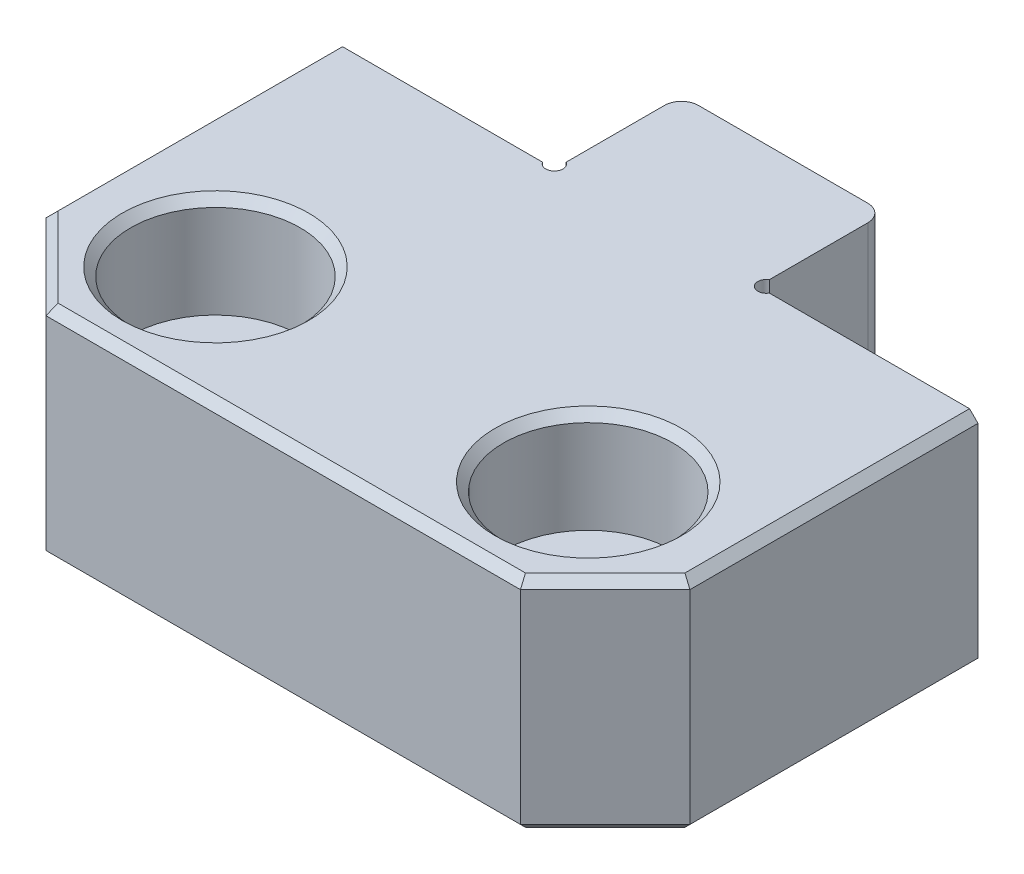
ISO-10303-21;
HEADER;
FILE_DESCRIPTION(('STEP AP214'),'2;1');
FILE_NAME('part.step','',(''),(''),'','','');
FILE_SCHEMA(('AUTOMOTIVE_DESIGN { 1 0 10303 214 1 1 1 1 }'));
ENDSEC;
DATA;
#1=APPLICATION_CONTEXT('core data for automotive mechanical design processes');
#2=APPLICATION_PROTOCOL_DEFINITION('international standard','automotive_design',2000,#1);
#3=PRODUCT_CONTEXT('',#1,'mechanical');
#4=PRODUCT('Part','Part','',(#3));
#5=PRODUCT_RELATED_PRODUCT_CATEGORY('part','',(#4));
#6=PRODUCT_DEFINITION_FORMATION('','',#4);
#7=PRODUCT_DEFINITION_CONTEXT('part definition',#1,'design');
#8=PRODUCT_DEFINITION('design','',#6,#7);
#9=PRODUCT_DEFINITION_SHAPE('','',#8);
#10=(LENGTH_UNIT() NAMED_UNIT(*) SI_UNIT(.MILLI.,.METRE.));
#11=(NAMED_UNIT(*) PLANE_ANGLE_UNIT() SI_UNIT($,.RADIAN.));
#12=(NAMED_UNIT(*) SI_UNIT($,.STERADIAN.) SOLID_ANGLE_UNIT());
#13=UNCERTAINTY_MEASURE_WITH_UNIT(LENGTH_MEASURE(1.E-05),#10,'distance_accuracy_value','');
#14=(GEOMETRIC_REPRESENTATION_CONTEXT(3) GLOBAL_UNCERTAINTY_ASSIGNED_CONTEXT((#13)) GLOBAL_UNIT_ASSIGNED_CONTEXT((#10,
#11,#12)) REPRESENTATION_CONTEXT('',''));
#15=CARTESIAN_POINT('',(0.,0.,0.));
#16=DIRECTION('',(0.,0.,1.));
#17=DIRECTION('',(1.,0.,0.));
#18=AXIS2_PLACEMENT_3D('',#15,#16,#17);
#19=CARTESIAN_POINT('',(-6.254,0.,-0.254));
#20=DIRECTION('',(0.,1.,0.));
#21=DIRECTION('',(0.,0.,1.));
#22=AXIS2_PLACEMENT_3D('',#19,#20,#21);
#23=PLANE('',#22);
#24=CARTESIAN_POINT('',(-11.,0.,15.));
#25=DIRECTION('',(0.,1.,0.));
#26=DIRECTION('',(0.,0.,1.));
#27=AXIS2_PLACEMENT_3D('',#24,#25,#26);
#28=CIRCLE('',#27,5.5);
#29=CARTESIAN_POINT('',(-11.,0.,20.5));
#30=VERTEX_POINT('',#29);
#31=EDGE_CURVE('E363',#30,#30,#28,.F.);
#32=ORIENTED_EDGE('',*,*,#31,.T.);
#33=EDGE_LOOP('',(#32));
#34=FACE_BOUND('',#33,.T.);
#35=CARTESIAN_POINT('',(11.,0.,15.));
#36=DIRECTION('',(0.,1.,0.));
#37=DIRECTION('',(0.,0.,1.));
#38=AXIS2_PLACEMENT_3D('',#35,#36,#37);
#39=CIRCLE('',#38,5.50000000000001);
#40=CARTESIAN_POINT('',(11.,0.,20.5));
#41=VERTEX_POINT('',#40);
#42=EDGE_CURVE('E360',#41,#41,#39,.F.);
#43=ORIENTED_EDGE('',*,*,#42,.T.);
#44=EDGE_LOOP('',(#43));
#45=FACE_BOUND('',#44,.T.);
#46=DIRECTION('',(0.707106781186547,0.,-0.707106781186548));
#47=VECTOR('',#46,1.);
#48=CARTESIAN_POINT('',(14.6464466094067,0.,20.6464466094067));
#49=LINE('',#48,#47);
#50=CARTESIAN_POINT('',(13.7928932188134,0.,21.5));
#51=VERTEX_POINT('',#50);
#52=CARTESIAN_POINT('',(18.5,0.,16.7928932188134));
#53=VERTEX_POINT('',#52);
#54=EDGE_CURVE('E54',#51,#53,#49,.T.);
#55=ORIENTED_EDGE('',*,*,#54,.T.);
#56=DIRECTION('',(0.,0.,-1.));
#57=VECTOR('',#56,1.);
#58=CARTESIAN_POINT('',(18.5,0.,-0.253999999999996));
#59=LINE('',#58,#57);
#60=CARTESIAN_POINT('',(18.5,0.,0.));
#61=VERTEX_POINT('',#60);
#62=EDGE_CURVE('E332',#53,#61,#59,.T.);
#63=ORIENTED_EDGE('',*,*,#62,.T.);
#64=DIRECTION('',(-1.,0.,0.));
#65=VECTOR('',#64,1.);
#66=CARTESIAN_POINT('',(6.68467853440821,0.,0.));
#67=LINE('',#66,#65);
#68=CARTESIAN_POINT('',(6.68467853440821,0.,0.));
#69=VERTEX_POINT('',#68);
#70=EDGE_CURVE('E217',#61,#69,#67,.T.);
#71=ORIENTED_EDGE('',*,*,#70,.T.);
#72=CARTESIAN_POINT('',(6.254,0.,-0.254));
#73=DIRECTION('',(0.,-1.,0.));
#74=DIRECTION('',(0.,0.,1.));
#75=AXIS2_PLACEMENT_3D('',#72,#73,#74);
#76=CIRCLE('',#75,0.5);
#77=CARTESIAN_POINT('',(6.,0.,-0.684678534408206));
#78=VERTEX_POINT('',#77);
#79=EDGE_CURVE('E220',#69,#78,#76,.T.);
#80=ORIENTED_EDGE('',*,*,#79,.T.);
#81=DIRECTION('',(0.,0.,-1.));
#82=VECTOR('',#81,1.);
#83=CARTESIAN_POINT('',(6.,0.,-7.5));
#84=LINE('',#83,#82);
#85=CARTESIAN_POINT('',(6.,0.,-6.5));
#86=VERTEX_POINT('',#85);
#87=EDGE_CURVE('E224',#78,#86,#84,.T.);
#88=ORIENTED_EDGE('',*,*,#87,.T.);
#89=CARTESIAN_POINT('',(5.,0.,-6.5));
#90=DIRECTION('',(0.,1.,0.));
#91=DIRECTION('',(0.,0.,1.));
#92=AXIS2_PLACEMENT_3D('',#89,#90,#91);
#93=CIRCLE('',#92,1.);
#94=CARTESIAN_POINT('',(5.,0.,-7.5));
#95=VERTEX_POINT('',#94);
#96=EDGE_CURVE('E255',#86,#95,#93,.T.);
#97=ORIENTED_EDGE('',*,*,#96,.T.);
#98=DIRECTION('',(-1.,0.,0.));
#99=VECTOR('',#98,1.);
#100=CARTESIAN_POINT('',(-6.,0.,-7.5));
#101=LINE('',#100,#99);
#102=CARTESIAN_POINT('',(-5.,0.,-7.5));
#103=VERTEX_POINT('',#102);
#104=EDGE_CURVE('E227',#95,#103,#101,.T.);
#105=ORIENTED_EDGE('',*,*,#104,.T.);
#106=CARTESIAN_POINT('',(-5.,0.,-6.5));
#107=DIRECTION('',(0.,1.,0.));
#108=DIRECTION('',(0.,0.,1.));
#109=AXIS2_PLACEMENT_3D('',#106,#107,#108);
#110=CIRCLE('',#109,1.);
#111=CARTESIAN_POINT('',(-6.,0.,-6.5));
#112=VERTEX_POINT('',#111);
#113=EDGE_CURVE('E257',#103,#112,#110,.T.);
#114=ORIENTED_EDGE('',*,*,#113,.T.);
#115=DIRECTION('',(0.,0.,1.));
#116=VECTOR('',#115,1.);
#117=CARTESIAN_POINT('',(-6.,0.,-0.693940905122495));
#118=LINE('',#117,#116);
#119=CARTESIAN_POINT('',(-6.,0.,-0.693940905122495));
#120=VERTEX_POINT('',#119);
#121=EDGE_CURVE('E230',#112,#120,#118,.T.);
#122=ORIENTED_EDGE('',*,*,#121,.T.);
#123=CARTESIAN_POINT('',(-6.254,0.,-0.254));
#124=DIRECTION('',(0.,-1.,0.));
#125=DIRECTION('',(0.,0.,1.));
#126=AXIS2_PLACEMENT_3D('',#123,#124,#125);
#127=CIRCLE('',#126,0.508);
#128=CARTESIAN_POINT('',(-6.69394090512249,0.,0.));
#129=VERTEX_POINT('',#128);
#130=EDGE_CURVE('E233',#120,#129,#127,.T.);
#131=ORIENTED_EDGE('',*,*,#130,.T.);
#132=DIRECTION('',(-1.,0.,0.));
#133=VECTOR('',#132,1.);
#134=CARTESIAN_POINT('',(-19.,0.,0.));
#135=LINE('',#134,#133);
#136=CARTESIAN_POINT('',(-18.5,0.,0.));
#137=VERTEX_POINT('',#136);
#138=EDGE_CURVE('E211',#129,#137,#135,.T.);
#139=ORIENTED_EDGE('',*,*,#138,.T.);
#140=DIRECTION('',(0.,0.,1.));
#141=VECTOR('',#140,1.);
#142=CARTESIAN_POINT('',(-18.5,0.,-0.254000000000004));
#143=LINE('',#142,#141);
#144=CARTESIAN_POINT('',(-18.5,0.,16.7928932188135));
#145=VERTEX_POINT('',#144);
#146=EDGE_CURVE('E325',#137,#145,#143,.T.);
#147=ORIENTED_EDGE('',*,*,#146,.T.);
#148=DIRECTION('',(0.707106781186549,0.,0.707106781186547));
#149=VECTOR('',#148,1.);
#150=CARTESIAN_POINT('',(-20.9004466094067,0.,14.3924466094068));
#151=LINE('',#150,#149);
#152=CARTESIAN_POINT('',(-13.7928932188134,0.,21.5));
#153=VERTEX_POINT('',#152);
#154=EDGE_CURVE('E327',#145,#153,#151,.T.);
#155=ORIENTED_EDGE('',*,*,#154,.T.);
#156=DIRECTION('',(1.,0.,0.));
#157=VECTOR('',#156,1.);
#158=CARTESIAN_POINT('',(-6.254,0.,21.5));
#159=LINE('',#158,#157);
#160=EDGE_CURVE('E329',#153,#51,#159,.T.);
#161=ORIENTED_EDGE('',*,*,#160,.T.);
#162=EDGE_LOOP('',(#55,#63,#71,#80,#88,#97,#105,#114,#122,#131,#139,#147,#155,#161));
#163=FACE_BOUND('',#162,.T.);
#164=ADVANCED_FACE('F32',(#34,#45,#163),#23,.T.);
#165=CARTESIAN_POINT('',(11.,-13.,15.));
#166=DIRECTION('',(0.,1.,0.));
#167=DIRECTION('',(0.,0.,1.));
#168=AXIS2_PLACEMENT_3D('',#165,#166,#167);
#169=CYLINDRICAL_SURFACE('',#168,2.9);
#170=CARTESIAN_POINT('',(11.,-13.,15.));
#171=DIRECTION('',(0.,1.,0.));
#172=DIRECTION('',(0.,0.,1.));
#173=AXIS2_PLACEMENT_3D('',#170,#171,#172);
#174=CIRCLE('',#173,2.9);
#175=CARTESIAN_POINT('',(11.,-13.,17.9));
#176=VERTEX_POINT('',#175);
#177=EDGE_CURVE('E280',#176,#176,#174,.T.);
#178=CARTESIAN_POINT('',(11.,-6.,15.));
#179=DIRECTION('',(0.,1.,0.));
#180=DIRECTION('',(0.,0.,1.));
#181=AXIS2_PLACEMENT_3D('',#178,#179,#180);
#182=CIRCLE('',#181,2.9);
#183=CARTESIAN_POINT('',(11.,-6.,17.9));
#184=VERTEX_POINT('',#183);
#185=EDGE_CURVE('E282',#184,#184,#182,.F.);
#186=CARTESIAN_POINT('',(11.,-13.,17.9));
#187=CARTESIAN_POINT('',(11.,-12.9270833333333,17.9));
#188=CARTESIAN_POINT('',(11.,-12.8541666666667,17.9));
#189=CARTESIAN_POINT('',(11.,-12.7083333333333,17.9));
#190=CARTESIAN_POINT('',(11.,-12.6354166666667,17.9));
#191=CARTESIAN_POINT('',(11.,-12.4895833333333,17.9));
#192=CARTESIAN_POINT('',(11.,-12.4166666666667,17.9));
#193=CARTESIAN_POINT('',(11.,-12.2708333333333,17.9));
#194=CARTESIAN_POINT('',(11.,-12.1979166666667,17.9));
#195=CARTESIAN_POINT('',(11.,-12.0520833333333,17.9));
#196=CARTESIAN_POINT('',(11.,-11.9791666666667,17.9));
#197=CARTESIAN_POINT('',(11.,-11.8333333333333,17.9));
#198=CARTESIAN_POINT('',(11.,-11.7604166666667,17.9));
#199=CARTESIAN_POINT('',(11.,-11.6145833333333,17.9));
#200=CARTESIAN_POINT('',(11.,-11.5416666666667,17.9));
#201=CARTESIAN_POINT('',(11.,-11.3958333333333,17.9));
#202=CARTESIAN_POINT('',(11.,-11.3229166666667,17.9));
#203=CARTESIAN_POINT('',(11.,-11.1770833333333,17.9));
#204=CARTESIAN_POINT('',(11.,-11.1041666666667,17.9));
#205=CARTESIAN_POINT('',(11.,-10.9583333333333,17.9));
#206=CARTESIAN_POINT('',(11.,-10.8854166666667,17.9));
#207=CARTESIAN_POINT('',(11.,-10.7395833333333,17.9));
#208=CARTESIAN_POINT('',(11.,-10.6666666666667,17.9));
#209=CARTESIAN_POINT('',(11.,-10.5208333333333,17.9));
#210=CARTESIAN_POINT('',(11.,-10.4479166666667,17.9));
#211=CARTESIAN_POINT('',(11.,-10.3020833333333,17.9));
#212=CARTESIAN_POINT('',(11.,-10.2291666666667,17.9));
#213=CARTESIAN_POINT('',(11.,-10.0833333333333,17.9));
#214=CARTESIAN_POINT('',(11.,-10.0104166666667,17.9));
#215=CARTESIAN_POINT('',(11.,-9.86458333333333,17.9));
#216=CARTESIAN_POINT('',(11.,-9.79166666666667,17.9));
#217=CARTESIAN_POINT('',(11.,-9.64583333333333,17.9));
#218=CARTESIAN_POINT('',(11.,-9.57291666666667,17.9));
#219=CARTESIAN_POINT('',(11.,-9.42708333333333,17.9));
#220=CARTESIAN_POINT('',(11.,-9.35416666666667,17.9));
#221=CARTESIAN_POINT('',(11.,-9.20833333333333,17.9));
#222=CARTESIAN_POINT('',(11.,-9.13541666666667,17.9));
#223=CARTESIAN_POINT('',(11.,-8.98958333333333,17.9));
#224=CARTESIAN_POINT('',(11.,-8.91666666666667,17.9));
#225=CARTESIAN_POINT('',(11.,-8.77083333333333,17.9));
#226=CARTESIAN_POINT('',(11.,-8.69791666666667,17.9));
#227=CARTESIAN_POINT('',(11.,-8.55208333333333,17.9));
#228=CARTESIAN_POINT('',(11.,-8.47916666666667,17.9));
#229=CARTESIAN_POINT('',(11.,-8.33333333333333,17.9));
#230=CARTESIAN_POINT('',(11.,-8.26041666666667,17.9));
#231=CARTESIAN_POINT('',(11.,-8.11458333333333,17.9));
#232=CARTESIAN_POINT('',(11.,-8.04166666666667,17.9));
#233=CARTESIAN_POINT('',(11.,-7.89583333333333,17.9));
#234=CARTESIAN_POINT('',(11.,-7.82291666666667,17.9));
#235=CARTESIAN_POINT('',(11.,-7.67708333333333,17.9));
#236=CARTESIAN_POINT('',(11.,-7.60416666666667,17.9));
#237=CARTESIAN_POINT('',(11.,-7.45833333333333,17.9));
#238=CARTESIAN_POINT('',(11.,-7.38541666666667,17.9));
#239=CARTESIAN_POINT('',(11.,-7.23958333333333,17.9));
#240=CARTESIAN_POINT('',(11.,-7.16666666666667,17.9));
#241=CARTESIAN_POINT('',(11.,-7.02083333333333,17.9));
#242=CARTESIAN_POINT('',(11.,-6.94791666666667,17.9));
#243=CARTESIAN_POINT('',(11.,-6.80208333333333,17.9));
#244=CARTESIAN_POINT('',(11.,-6.72916666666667,17.9));
#245=CARTESIAN_POINT('',(11.,-6.58333333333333,17.9));
#246=CARTESIAN_POINT('',(11.,-6.51041666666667,17.9));
#247=CARTESIAN_POINT('',(11.,-6.36458333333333,17.9));
#248=CARTESIAN_POINT('',(11.,-6.29166666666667,17.9));
#249=CARTESIAN_POINT('',(11.,-6.14583333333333,17.9));
#250=CARTESIAN_POINT('',(11.,-6.07291666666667,17.9));
#251=CARTESIAN_POINT('',(11.,-6.,17.9));
#252=B_SPLINE_CURVE_WITH_KNOTS('',3,(#186,#187,#188,#189,#190,#191,#192,#193,#194,#195,#196,
#197,#198,#199,#200,#201,#202,#203,#204,#205,#206,#207,#208,#209,#210,#211,#212,#213,#214,#215,
#216,#217,#218,#219,#220,#221,#222,#223,#224,#225,#226,#227,#228,#229,#230,#231,#232,#233,#234,
#235,#236,#237,#238,#239,#240,#241,#242,#243,#244,#245,#246,#247,#248,#249,#250,#251),
.UNSPECIFIED.,.F.,.F.,(4,2,2,2,2,2,2,2,2,2,2,2,2,2,2,2,2,2,2,2,2,2,2,2,2,2,2,2,2,2,2,2,4),(0.,
0.218749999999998,0.437499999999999,0.656249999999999,0.874999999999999,1.09375,1.3125,1.53125,
1.75,1.96875,2.1875,2.40625,2.625,2.84375,3.0625,3.28125,3.5,3.71875,3.9375,4.15625,4.375,
4.59375,4.8125,5.03125,5.25,5.46875,5.6875,5.90625,6.125,6.34375,6.5625,6.78125,7.),.UNSPECIFIED.);
#253=EDGE_CURVE('BSEAM377',#176,#184,#252,.T.);
#254=ORIENTED_EDGE('',*,*,#177,.F.);
#255=ORIENTED_EDGE('',*,*,#185,.F.);
#256=ORIENTED_EDGE('',*,*,#253,.T.);
#257=ORIENTED_EDGE('',*,*,#253,.F.);
#258=EDGE_LOOP('',(#254,#256,#255,#257));
#259=FACE_BOUND('',#258,.T.);
#260=ADVANCED_FACE('F377',(#259),#169,.F.);
#261=CARTESIAN_POINT('',(-11.,-13.,15.));
#262=DIRECTION('',(0.,1.,0.));
#263=DIRECTION('',(0.,0.,1.));
#264=AXIS2_PLACEMENT_3D('',#261,#262,#263);
#265=CYLINDRICAL_SURFACE('',#264,2.9);
#266=CARTESIAN_POINT('',(-11.,-13.,15.));
#267=DIRECTION('',(0.,1.,0.));
#268=DIRECTION('',(0.,0.,1.));
#269=AXIS2_PLACEMENT_3D('',#266,#267,#268);
#270=CIRCLE('',#269,2.9);
#271=CARTESIAN_POINT('',(-11.,-13.,17.9));
#272=VERTEX_POINT('',#271);
#273=EDGE_CURVE('E221',#272,#272,#270,.T.);
#274=CARTESIAN_POINT('',(-11.,-6.,15.));
#275=DIRECTION('',(0.,1.,0.));
#276=DIRECTION('',(0.,0.,1.));
#277=AXIS2_PLACEMENT_3D('',#274,#275,#276);
#278=CIRCLE('',#277,2.9);
#279=CARTESIAN_POINT('',(-11.,-6.,17.9));
#280=VERTEX_POINT('',#279);
#281=EDGE_CURVE('E277',#280,#280,#278,.F.);
#282=CARTESIAN_POINT('',(-11.,-13.,17.9));
#283=CARTESIAN_POINT('',(-11.,-12.9270833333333,17.9));
#284=CARTESIAN_POINT('',(-11.,-12.8541666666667,17.9));
#285=CARTESIAN_POINT('',(-11.,-12.7083333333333,17.9));
#286=CARTESIAN_POINT('',(-11.,-12.6354166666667,17.9));
#287=CARTESIAN_POINT('',(-11.,-12.4895833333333,17.9));
#288=CARTESIAN_POINT('',(-11.,-12.4166666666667,17.9));
#289=CARTESIAN_POINT('',(-11.,-12.2708333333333,17.9));
#290=CARTESIAN_POINT('',(-11.,-12.1979166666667,17.9));
#291=CARTESIAN_POINT('',(-11.,-12.0520833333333,17.9));
#292=CARTESIAN_POINT('',(-11.,-11.9791666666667,17.9));
#293=CARTESIAN_POINT('',(-11.,-11.8333333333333,17.9));
#294=CARTESIAN_POINT('',(-11.,-11.7604166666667,17.9));
#295=CARTESIAN_POINT('',(-11.,-11.6145833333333,17.9));
#296=CARTESIAN_POINT('',(-11.,-11.5416666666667,17.9));
#297=CARTESIAN_POINT('',(-11.,-11.3958333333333,17.9));
#298=CARTESIAN_POINT('',(-11.,-11.3229166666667,17.9));
#299=CARTESIAN_POINT('',(-11.,-11.1770833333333,17.9));
#300=CARTESIAN_POINT('',(-11.,-11.1041666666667,17.9));
#301=CARTESIAN_POINT('',(-11.,-10.9583333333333,17.9));
#302=CARTESIAN_POINT('',(-11.,-10.8854166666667,17.9));
#303=CARTESIAN_POINT('',(-11.,-10.7395833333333,17.9));
#304=CARTESIAN_POINT('',(-11.,-10.6666666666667,17.9));
#305=CARTESIAN_POINT('',(-11.,-10.5208333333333,17.9));
#306=CARTESIAN_POINT('',(-11.,-10.4479166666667,17.9));
#307=CARTESIAN_POINT('',(-11.,-10.3020833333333,17.9));
#308=CARTESIAN_POINT('',(-11.,-10.2291666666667,17.9));
#309=CARTESIAN_POINT('',(-11.,-10.0833333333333,17.9));
#310=CARTESIAN_POINT('',(-11.,-10.0104166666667,17.9));
#311=CARTESIAN_POINT('',(-11.,-9.86458333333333,17.9));
#312=CARTESIAN_POINT('',(-11.,-9.79166666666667,17.9));
#313=CARTESIAN_POINT('',(-11.,-9.64583333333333,17.9));
#314=CARTESIAN_POINT('',(-11.,-9.57291666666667,17.9));
#315=CARTESIAN_POINT('',(-11.,-9.42708333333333,17.9));
#316=CARTESIAN_POINT('',(-11.,-9.35416666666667,17.9));
#317=CARTESIAN_POINT('',(-11.,-9.20833333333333,17.9));
#318=CARTESIAN_POINT('',(-11.,-9.13541666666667,17.9));
#319=CARTESIAN_POINT('',(-11.,-8.98958333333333,17.9));
#320=CARTESIAN_POINT('',(-11.,-8.91666666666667,17.9));
#321=CARTESIAN_POINT('',(-11.,-8.77083333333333,17.9));
#322=CARTESIAN_POINT('',(-11.,-8.69791666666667,17.9));
#323=CARTESIAN_POINT('',(-11.,-8.55208333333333,17.9));
#324=CARTESIAN_POINT('',(-11.,-8.47916666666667,17.9));
#325=CARTESIAN_POINT('',(-11.,-8.33333333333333,17.9));
#326=CARTESIAN_POINT('',(-11.,-8.26041666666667,17.9));
#327=CARTESIAN_POINT('',(-11.,-8.11458333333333,17.9));
#328=CARTESIAN_POINT('',(-11.,-8.04166666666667,17.9));
#329=CARTESIAN_POINT('',(-11.,-7.89583333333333,17.9));
#330=CARTESIAN_POINT('',(-11.,-7.82291666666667,17.9));
#331=CARTESIAN_POINT('',(-11.,-7.67708333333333,17.9));
#332=CARTESIAN_POINT('',(-11.,-7.60416666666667,17.9));
#333=CARTESIAN_POINT('',(-11.,-7.45833333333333,17.9));
#334=CARTESIAN_POINT('',(-11.,-7.38541666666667,17.9));
#335=CARTESIAN_POINT('',(-11.,-7.23958333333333,17.9));
#336=CARTESIAN_POINT('',(-11.,-7.16666666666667,17.9));
#337=CARTESIAN_POINT('',(-11.,-7.02083333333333,17.9));
#338=CARTESIAN_POINT('',(-11.,-6.94791666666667,17.9));
#339=CARTESIAN_POINT('',(-11.,-6.80208333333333,17.9));
#340=CARTESIAN_POINT('',(-11.,-6.72916666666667,17.9));
#341=CARTESIAN_POINT('',(-11.,-6.58333333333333,17.9));
#342=CARTESIAN_POINT('',(-11.,-6.51041666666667,17.9));
#343=CARTESIAN_POINT('',(-11.,-6.36458333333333,17.9));
#344=CARTESIAN_POINT('',(-11.,-6.29166666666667,17.9));
#345=CARTESIAN_POINT('',(-11.,-6.14583333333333,17.9));
#346=CARTESIAN_POINT('',(-11.,-6.07291666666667,17.9));
#347=CARTESIAN_POINT('',(-11.,-6.,17.9));
#348=B_SPLINE_CURVE_WITH_KNOTS('',3,(#282,#283,#284,#285,#286,#287,#288,#289,#290,#291,#292,
#293,#294,#295,#296,#297,#298,#299,#300,#301,#302,#303,#304,#305,#306,#307,#308,#309,#310,#311,
#312,#313,#314,#315,#316,#317,#318,#319,#320,#321,#322,#323,#324,#325,#326,#327,#328,#329,#330,
#331,#332,#333,#334,#335,#336,#337,#338,#339,#340,#341,#342,#343,#344,#345,#346,#347),
.UNSPECIFIED.,.F.,.F.,(4,2,2,2,2,2,2,2,2,2,2,2,2,2,2,2,2,2,2,2,2,2,2,2,2,2,2,2,2,2,2,2,4),(0.,
0.218749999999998,0.437499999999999,0.656249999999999,0.874999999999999,1.09375,1.3125,1.53125,
1.75,1.96875,2.1875,2.40625,2.625,2.84375,3.0625,3.28125,3.5,3.71875,3.9375,4.15625,4.375,
4.59375,4.8125,5.03125,5.25,5.46875,5.6875,5.90625,6.125,6.34375,6.5625,6.78125,7.),.UNSPECIFIED.);
#349=EDGE_CURVE('BSEAM383',#272,#280,#348,.T.);
#350=ORIENTED_EDGE('',*,*,#273,.F.);
#351=ORIENTED_EDGE('',*,*,#281,.F.);
#352=ORIENTED_EDGE('',*,*,#349,.T.);
#353=ORIENTED_EDGE('',*,*,#349,.F.);
#354=EDGE_LOOP('',(#350,#352,#351,#353));
#355=FACE_BOUND('',#354,.T.);
#356=ADVANCED_FACE('F383',(#355),#265,.F.);
#357=CARTESIAN_POINT('',(-19.,-13.,22.));
#358=DIRECTION('',(-1.,0.,0.));
#359=DIRECTION('',(0.,0.,1.));
#360=AXIS2_PLACEMENT_3D('',#357,#358,#359);
#361=PLANE('',#360);
#362=DIRECTION('',(0.,1.,0.));
#363=VECTOR('',#362,1.);
#364=CARTESIAN_POINT('',(-19.,-13.,0.));
#365=LINE('',#364,#363);
#366=CARTESIAN_POINT('',(-19.,-12.5,0.));
#367=VERTEX_POINT('',#366);
#368=CARTESIAN_POINT('',(-19.,-0.500000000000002,0.));
#369=VERTEX_POINT('',#368);
#370=EDGE_CURVE('E238',#367,#369,#365,.T.);
#371=ORIENTED_EDGE('',*,*,#370,.F.);
#372=DIRECTION('',(0.,0.,1.));
#373=VECTOR('',#372,1.);
#374=CARTESIAN_POINT('',(-19.,-12.5,17.));
#375=LINE('',#374,#373);
#376=CARTESIAN_POINT('',(-19.,-12.5,17.));
#377=VERTEX_POINT('',#376);
#378=EDGE_CURVE('E287',#367,#377,#375,.T.);
#379=ORIENTED_EDGE('',*,*,#378,.T.);
#380=DIRECTION('',(0.,1.,0.));
#381=VECTOR('',#380,1.);
#382=CARTESIAN_POINT('',(-19.,-13.,17.));
#383=LINE('',#382,#381);
#384=CARTESIAN_POINT('',(-19.,-0.5,17.));
#385=VERTEX_POINT('',#384);
#386=EDGE_CURVE('E273',#377,#385,#383,.T.);
#387=ORIENTED_EDGE('',*,*,#386,.T.);
#388=DIRECTION('',(0.,0.,-1.));
#389=VECTOR('',#388,1.);
#390=CARTESIAN_POINT('',(-19.,-0.5,22.));
#391=LINE('',#390,#389);
#392=EDGE_CURVE('E276',#385,#369,#391,.T.);
#393=ORIENTED_EDGE('',*,*,#392,.T.);
#394=EDGE_LOOP('',(#371,#379,#387,#393));
#395=FACE_BOUND('',#394,.T.);
#396=ADVANCED_FACE('F393',(#395),#361,.T.);
#397=CARTESIAN_POINT('',(-19.,-13.,0.));
#398=DIRECTION('',(0.,0.,-1.));
#399=DIRECTION('',(-1.,0.,0.));
#400=AXIS2_PLACEMENT_3D('',#397,#398,#399);
#401=PLANE('',#400);
#402=DIRECTION('',(-1.,0.,0.));
#403=VECTOR('',#402,1.);
#404=CARTESIAN_POINT('',(-19.,-13.,0.));
#405=LINE('',#404,#403);
#406=CARTESIAN_POINT('',(-6.69394090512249,-13.,0.));
#407=VERTEX_POINT('',#406);
#408=CARTESIAN_POINT('',(-18.5,-13.,0.));
#409=VERTEX_POINT('',#408);
#410=EDGE_CURVE('E209',#407,#409,#405,.T.);
#411=ORIENTED_EDGE('',*,*,#410,.T.);
#412=DIRECTION('',(-0.707106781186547,0.707106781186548,0.));
#413=VECTOR('',#412,1.);
#414=CARTESIAN_POINT('',(-18.75,-12.75,0.));
#415=LINE('',#414,#413);
#416=EDGE_CURVE('E303',#409,#367,#415,.T.);
#417=ORIENTED_EDGE('',*,*,#416,.T.);
#418=ORIENTED_EDGE('',*,*,#370,.T.);
#419=DIRECTION('',(-0.707106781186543,-0.707106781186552,0.));
#420=VECTOR('',#419,1.);
#421=CARTESIAN_POINT('',(-25.25,-6.75000000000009,0.));
#422=LINE('',#421,#420);
#423=EDGE_CURVE('E301',#369,#137,#422,.F.);
#424=ORIENTED_EDGE('',*,*,#423,.T.);
#425=ORIENTED_EDGE('',*,*,#138,.F.);
#426=DIRECTION('',(0.,1.,0.));
#427=VECTOR('',#426,1.);
#428=CARTESIAN_POINT('',(-6.69394090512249,-13.,0.));
#429=LINE('',#428,#427);
#430=EDGE_CURVE('E242',#407,#129,#429,.T.);
#431=ORIENTED_EDGE('',*,*,#430,.F.);
#432=EDGE_LOOP('',(#411,#417,#418,#424,#425,#431));
#433=FACE_BOUND('',#432,.T.);
#434=ADVANCED_FACE('F389',(#433),#401,.T.);
#435=CARTESIAN_POINT('',(-6.254,-13.,-0.254));
#436=DIRECTION('',(0.,1.,0.));
#437=DIRECTION('',(0.,0.,1.));
#438=AXIS2_PLACEMENT_3D('',#435,#436,#437);
#439=CYLINDRICAL_SURFACE('',#438,0.508);
#440=DIRECTION('',(0.,1.,0.));
#441=VECTOR('',#440,1.);
#442=CARTESIAN_POINT('',(-5.81405909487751,-13.,0.));
#443=LINE('',#442,#441);
#444=CARTESIAN_POINT('',(-5.81405909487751,-13.,0.));
#445=VERTEX_POINT('',#444);
#446=CARTESIAN_POINT('',(-5.81405909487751,-12.5,0.));
#447=VERTEX_POINT('',#446);
#448=EDGE_CURVE('E191',#445,#447,#443,.T.);
#449=ORIENTED_EDGE('',*,*,#448,.F.);
#450=CARTESIAN_POINT('',(-6.254,-13.,-0.254));
#451=DIRECTION('',(0.,-1.,0.));
#452=DIRECTION('',(0.,0.,1.));
#453=AXIS2_PLACEMENT_3D('',#450,#451,#452);
#454=CIRCLE('',#453,0.508);
#455=EDGE_CURVE('E201',#445,#407,#454,.T.);
#456=ORIENTED_EDGE('',*,*,#455,.T.);
#457=ORIENTED_EDGE('',*,*,#430,.T.);
#458=ORIENTED_EDGE('',*,*,#130,.F.);
#459=DIRECTION('',(0.,1.,0.));
#460=VECTOR('',#459,1.);
#461=CARTESIAN_POINT('',(-6.,-13.,-0.693940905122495));
#462=LINE('',#461,#460);
#463=CARTESIAN_POINT('',(-6.,-12.5,-0.693940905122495));
#464=VERTEX_POINT('',#463);
#465=EDGE_CURVE('E244',#464,#120,#462,.T.);
#466=ORIENTED_EDGE('',*,*,#465,.F.);
#467=CARTESIAN_POINT('',(-6.254,-12.5,-0.254));
#468=DIRECTION('',(0.,1.,0.));
#469=DIRECTION('',(0.,0.,1.));
#470=AXIS2_PLACEMENT_3D('',#467,#468,#469);
#471=CIRCLE('',#470,0.508);
#472=EDGE_CURVE('E192',#447,#464,#471,.T.);
#473=ORIENTED_EDGE('',*,*,#472,.F.);
#474=EDGE_LOOP('',(#449,#456,#457,#458,#466,#473));
#475=FACE_BOUND('',#474,.T.);
#476=ADVANCED_FACE('F392',(#475),#439,.F.);
#477=CARTESIAN_POINT('',(-6.,-13.,-0.693940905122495));
#478=DIRECTION('',(-1.,0.,0.));
#479=DIRECTION('',(0.,0.,1.));
#480=AXIS2_PLACEMENT_3D('',#477,#478,#479);
#481=PLANE('',#480);
#482=DIRECTION('',(0.,0.,-1.));
#483=VECTOR('',#482,1.);
#484=CARTESIAN_POINT('',(-6.,-12.5,-0.693940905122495));
#485=LINE('',#484,#483);
#486=CARTESIAN_POINT('',(-6.,-12.5,-6.5));
#487=VERTEX_POINT('',#486);
#488=EDGE_CURVE('E530',#464,#487,#485,.T.);
#489=ORIENTED_EDGE('',*,*,#488,.F.);
#490=ORIENTED_EDGE('',*,*,#465,.T.);
#491=ORIENTED_EDGE('',*,*,#121,.F.);
#492=DIRECTION('',(0.,1.,0.));
#493=VECTOR('',#492,1.);
#494=CARTESIAN_POINT('',(-6.,-13.,-6.5));
#495=LINE('',#494,#493);
#496=EDGE_CURVE('E259',#112,#487,#495,.F.);
#497=ORIENTED_EDGE('',*,*,#496,.T.);
#498=EDGE_LOOP('',(#489,#490,#491,#497));
#499=FACE_BOUND('',#498,.T.);
#500=ADVANCED_FACE('F397',(#499),#481,.T.);
#501=CARTESIAN_POINT('',(-6.,-13.,-7.5));
#502=DIRECTION('',(0.,0.,-1.));
#503=DIRECTION('',(-1.,0.,0.));
#504=AXIS2_PLACEMENT_3D('',#501,#502,#503);
#505=PLANE('',#504);
#506=DIRECTION('',(1.,0.,0.));
#507=VECTOR('',#506,1.);
#508=CARTESIAN_POINT('',(-6.,-12.5,-7.5));
#509=LINE('',#508,#507);
#510=CARTESIAN_POINT('',(-5.,-12.5,-7.5));
#511=VERTEX_POINT('',#510);
#512=CARTESIAN_POINT('',(5.,-12.5,-7.5));
#513=VERTEX_POINT('',#512);
#514=EDGE_CURVE('E46',#511,#513,#509,.T.);
#515=ORIENTED_EDGE('',*,*,#514,.F.);
#516=DIRECTION('',(0.,1.,0.));
#517=VECTOR('',#516,1.);
#518=CARTESIAN_POINT('',(-5.,-13.,-7.5));
#519=LINE('',#518,#517);
#520=EDGE_CURVE('E253',#511,#103,#519,.T.);
#521=ORIENTED_EDGE('',*,*,#520,.T.);
#522=ORIENTED_EDGE('',*,*,#104,.F.);
#523=DIRECTION('',(0.,1.,0.));
#524=VECTOR('',#523,1.);
#525=CARTESIAN_POINT('',(5.,-13.,-7.5));
#526=LINE('',#525,#524);
#527=EDGE_CURVE('E241',#95,#513,#526,.F.);
#528=ORIENTED_EDGE('',*,*,#527,.T.);
#529=EDGE_LOOP('',(#515,#521,#522,#528));
#530=FACE_BOUND('',#529,.T.);
#531=ADVANCED_FACE('F401',(#530),#505,.T.);
#532=CARTESIAN_POINT('',(6.,-13.,-7.5));
#533=DIRECTION('',(1.,0.,0.));
#534=DIRECTION('',(0.,0.,-1.));
#535=AXIS2_PLACEMENT_3D('',#532,#533,#534);
#536=PLANE('',#535);
#537=DIRECTION('',(0.,0.,1.));
#538=VECTOR('',#537,1.);
#539=CARTESIAN_POINT('',(6.,-12.5,-7.5));
#540=LINE('',#539,#538);
#541=CARTESIAN_POINT('',(6.,-12.5,-6.5));
#542=VERTEX_POINT('',#541);
#543=CARTESIAN_POINT('',(6.,-12.5,-0.684678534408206));
#544=VERTEX_POINT('',#543);
#545=EDGE_CURVE('E586',#542,#544,#540,.T.);
#546=ORIENTED_EDGE('',*,*,#545,.F.);
#547=DIRECTION('',(0.,1.,0.));
#548=VECTOR('',#547,1.);
#549=CARTESIAN_POINT('',(6.,-13.,-6.5));
#550=LINE('',#549,#548);
#551=EDGE_CURVE('E262',#542,#86,#550,.T.);
#552=ORIENTED_EDGE('',*,*,#551,.T.);
#553=ORIENTED_EDGE('',*,*,#87,.F.);
#554=DIRECTION('',(0.,1.,0.));
#555=VECTOR('',#554,1.);
#556=CARTESIAN_POINT('',(6.,-13.,-0.684678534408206));
#557=LINE('',#556,#555);
#558=EDGE_CURVE('E246',#544,#78,#557,.T.);
#559=ORIENTED_EDGE('',*,*,#558,.F.);
#560=EDGE_LOOP('',(#546,#552,#553,#559));
#561=FACE_BOUND('',#560,.T.);
#562=ADVANCED_FACE('F405',(#561),#536,.T.);
#563=CARTESIAN_POINT('',(6.254,-13.,-0.254));
#564=DIRECTION('',(0.,1.,0.));
#565=DIRECTION('',(0.,0.,1.));
#566=AXIS2_PLACEMENT_3D('',#563,#564,#565);
#567=CYLINDRICAL_SURFACE('',#566,0.5);
#568=DIRECTION('',(0.,1.,0.));
#569=VECTOR('',#568,1.);
#570=CARTESIAN_POINT('',(5.8233214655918,-13.,0.));
#571=LINE('',#570,#569);
#572=CARTESIAN_POINT('',(5.8233214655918,-12.5,0.));
#573=VERTEX_POINT('',#572);
#574=CARTESIAN_POINT('',(5.82332146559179,-13.,0.));
#575=VERTEX_POINT('',#574);
#576=EDGE_CURVE('E181',#573,#575,#571,.F.);
#577=ORIENTED_EDGE('',*,*,#576,.F.);
#578=CARTESIAN_POINT('',(6.254,-12.5,-0.254));
#579=DIRECTION('',(0.,1.,0.));
#580=DIRECTION('',(0.,0.,1.));
#581=AXIS2_PLACEMENT_3D('',#578,#579,#580);
#582=CIRCLE('',#581,0.5);
#583=EDGE_CURVE('E536',#544,#573,#582,.T.);
#584=ORIENTED_EDGE('',*,*,#583,.F.);
#585=ORIENTED_EDGE('',*,*,#558,.T.);
#586=ORIENTED_EDGE('',*,*,#79,.F.);
#587=DIRECTION('',(0.,1.,0.));
#588=VECTOR('',#587,1.);
#589=CARTESIAN_POINT('',(6.68467853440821,-13.,0.));
#590=LINE('',#589,#588);
#591=CARTESIAN_POINT('',(6.68467853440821,-13.,0.));
#592=VERTEX_POINT('',#591);
#593=EDGE_CURVE('E206',#592,#69,#590,.T.);
#594=ORIENTED_EDGE('',*,*,#593,.F.);
#595=CARTESIAN_POINT('',(6.254,-13.,-0.254));
#596=DIRECTION('',(0.,-1.,0.));
#597=DIRECTION('',(0.,0.,1.));
#598=AXIS2_PLACEMENT_3D('',#595,#596,#597);
#599=CIRCLE('',#598,0.5);
#600=EDGE_CURVE('E199',#592,#575,#599,.T.);
#601=ORIENTED_EDGE('',*,*,#600,.T.);
#602=EDGE_LOOP('',(#577,#584,#585,#586,#594,#601));
#603=FACE_BOUND('',#602,.T.);
#604=ADVANCED_FACE('F204',(#603),#567,.F.);
#605=CARTESIAN_POINT('',(6.68467853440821,-13.,0.));
#606=DIRECTION('',(0.,0.,-1.));
#607=DIRECTION('',(-1.,0.,0.));
#608=AXIS2_PLACEMENT_3D('',#605,#606,#607);
#609=PLANE('',#608);
#610=DIRECTION('',(-1.,0.,0.));
#611=VECTOR('',#610,1.);
#612=CARTESIAN_POINT('',(6.68467853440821,-13.,0.));
#613=LINE('',#612,#611);
#614=CARTESIAN_POINT('',(18.5,-13.,0.));
#615=VERTEX_POINT('',#614);
#616=EDGE_CURVE('E207',#615,#592,#613,.T.);
#617=ORIENTED_EDGE('',*,*,#616,.T.);
#618=ORIENTED_EDGE('',*,*,#593,.T.);
#619=ORIENTED_EDGE('',*,*,#70,.F.);
#620=DIRECTION('',(-0.707106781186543,0.707106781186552,0.));
#621=VECTOR('',#620,1.);
#622=CARTESIAN_POINT('',(19.0923392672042,-0.592339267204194,0.));
#623=LINE('',#622,#621);
#624=CARTESIAN_POINT('',(19.,-0.500000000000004,0.));
#625=VERTEX_POINT('',#624);
#626=EDGE_CURVE('E321',#61,#625,#623,.F.);
#627=ORIENTED_EDGE('',*,*,#626,.T.);
#628=DIRECTION('',(0.,1.,0.));
#629=VECTOR('',#628,1.);
#630=CARTESIAN_POINT('',(19.,-13.,0.));
#631=LINE('',#630,#629);
#632=CARTESIAN_POINT('',(19.,-12.5,0.));
#633=VERTEX_POINT('',#632);
#634=EDGE_CURVE('E216',#633,#625,#631,.T.);
#635=ORIENTED_EDGE('',*,*,#634,.F.);
#636=DIRECTION('',(-0.707106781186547,-0.707106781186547,0.));
#637=VECTOR('',#636,1.);
#638=CARTESIAN_POINT('',(12.5923392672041,-18.9076607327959,0.));
#639=LINE('',#638,#637);
#640=EDGE_CURVE('E323',#633,#615,#639,.T.);
#641=ORIENTED_EDGE('',*,*,#640,.T.);
#642=EDGE_LOOP('',(#617,#618,#619,#627,#635,#641));
#643=FACE_BOUND('',#642,.T.);
#644=ADVANCED_FACE('F412',(#643),#609,.T.);
#645=CARTESIAN_POINT('',(19.,-13.,22.));
#646=DIRECTION('',(1.,0.,0.));
#647=DIRECTION('',(0.,0.,-1.));
#648=AXIS2_PLACEMENT_3D('',#645,#646,#647);
#649=PLANE('',#648);
#650=DIRECTION('',(0.,-1.,0.));
#651=VECTOR('',#650,1.);
#652=CARTESIAN_POINT('',(19.,-13.,17.));
#653=LINE('',#652,#651);
#654=CARTESIAN_POINT('',(19.,-0.5,17.));
#655=VERTEX_POINT('',#654);
#656=CARTESIAN_POINT('',(19.,-12.5,17.));
#657=VERTEX_POINT('',#656);
#658=EDGE_CURVE('E270',#655,#657,#653,.T.);
#659=ORIENTED_EDGE('',*,*,#658,.T.);
#660=DIRECTION('',(0.,0.,-1.));
#661=VECTOR('',#660,1.);
#662=CARTESIAN_POINT('',(19.,-12.5,0.));
#663=LINE('',#662,#661);
#664=EDGE_CURVE('E319',#657,#633,#663,.T.);
#665=ORIENTED_EDGE('',*,*,#664,.T.);
#666=ORIENTED_EDGE('',*,*,#634,.T.);
#667=DIRECTION('',(0.,0.,1.));
#668=VECTOR('',#667,1.);
#669=CARTESIAN_POINT('',(19.,-0.5,22.));
#670=LINE('',#669,#668);
#671=EDGE_CURVE('E317',#625,#655,#670,.T.);
#672=ORIENTED_EDGE('',*,*,#671,.T.);
#673=EDGE_LOOP('',(#659,#665,#666,#672));
#674=FACE_BOUND('',#673,.T.);
#675=ADVANCED_FACE('F415',(#674),#649,.T.);
#676=CARTESIAN_POINT('',(-19.,-13.,22.));
#677=DIRECTION('',(0.,0.,1.));
#678=DIRECTION('',(1.,0.,0.));
#679=AXIS2_PLACEMENT_3D('',#676,#677,#678);
#680=PLANE('',#679);
#681=DIRECTION('',(0.,-1.,0.));
#682=VECTOR('',#681,1.);
#683=CARTESIAN_POINT('',(-14.,-13.,22.));
#684=LINE('',#683,#682);
#685=CARTESIAN_POINT('',(-14.,-0.5,22.));
#686=VERTEX_POINT('',#685);
#687=CARTESIAN_POINT('',(-14.,-12.5,22.));
#688=VERTEX_POINT('',#687);
#689=EDGE_CURVE('E264',#686,#688,#684,.T.);
#690=ORIENTED_EDGE('',*,*,#689,.T.);
#691=DIRECTION('',(1.,0.,0.));
#692=VECTOR('',#691,1.);
#693=CARTESIAN_POINT('',(14.,-12.5,22.));
#694=LINE('',#693,#692);
#695=CARTESIAN_POINT('',(14.,-12.5,22.));
#696=VERTEX_POINT('',#695);
#697=EDGE_CURVE('E311',#688,#696,#694,.T.);
#698=ORIENTED_EDGE('',*,*,#697,.T.);
#699=DIRECTION('',(0.,1.,0.));
#700=VECTOR('',#699,1.);
#701=CARTESIAN_POINT('',(14.,-13.,22.));
#702=LINE('',#701,#700);
#703=CARTESIAN_POINT('',(14.,-0.5,22.));
#704=VERTEX_POINT('',#703);
#705=EDGE_CURVE('E267',#696,#704,#702,.T.);
#706=ORIENTED_EDGE('',*,*,#705,.T.);
#707=DIRECTION('',(-1.,0.,0.));
#708=VECTOR('',#707,1.);
#709=CARTESIAN_POINT('',(-19.,-0.5,22.));
#710=LINE('',#709,#708);
#711=EDGE_CURVE('E309',#704,#686,#710,.T.);
#712=ORIENTED_EDGE('',*,*,#711,.T.);
#713=EDGE_LOOP('',(#690,#698,#706,#712));
#714=FACE_BOUND('',#713,.T.);
#715=ADVANCED_FACE('F419',(#714),#680,.T.);
#716=CARTESIAN_POINT('',(-6.254,-13.,-0.254));
#717=DIRECTION('',(0.,1.,0.));
#718=DIRECTION('',(0.,0.,1.));
#719=AXIS2_PLACEMENT_3D('',#716,#717,#718);
#720=PLANE('',#719);
#721=ORIENTED_EDGE('',*,*,#177,.T.);
#722=EDGE_LOOP('',(#721));
#723=FACE_BOUND('',#722,.T.);
#724=ORIENTED_EDGE('',*,*,#273,.T.);
#725=EDGE_LOOP('',(#724));
#726=FACE_BOUND('',#725,.T.);
#727=ORIENTED_EDGE('',*,*,#455,.F.);
#728=DIRECTION('',(-1.,0.,0.));
#729=VECTOR('',#728,1.);
#730=CARTESIAN_POINT('',(-16.234064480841,-13.,0.));
#731=LINE('',#730,#729);
#732=EDGE_CURVE('E184',#575,#445,#731,.T.);
#733=ORIENTED_EDGE('',*,*,#732,.F.);
#734=ORIENTED_EDGE('',*,*,#600,.F.);
#735=ORIENTED_EDGE('',*,*,#616,.F.);
#736=DIRECTION('',(0.,0.,1.));
#737=VECTOR('',#736,1.);
#738=CARTESIAN_POINT('',(18.5,-13.,17.));
#739=LINE('',#738,#737);
#740=CARTESIAN_POINT('',(18.5,-13.,16.7928932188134));
#741=VERTEX_POINT('',#740);
#742=EDGE_CURVE('E290',#615,#741,#739,.T.);
#743=ORIENTED_EDGE('',*,*,#742,.T.);
#744=DIRECTION('',(-0.707106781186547,0.,0.707106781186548));
#745=VECTOR('',#744,1.);
#746=CARTESIAN_POINT('',(13.6464466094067,-13.,21.6464466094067));
#747=LINE('',#746,#745);
#748=CARTESIAN_POINT('',(13.7928932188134,-13.,21.5));
#749=VERTEX_POINT('',#748);
#750=EDGE_CURVE('E292',#741,#749,#747,.T.);
#751=ORIENTED_EDGE('',*,*,#750,.T.);
#752=DIRECTION('',(-1.,0.,0.));
#753=VECTOR('',#752,1.);
#754=CARTESIAN_POINT('',(-14.,-13.,21.5));
#755=LINE('',#754,#753);
#756=CARTESIAN_POINT('',(-13.7928932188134,-13.,21.5));
#757=VERTEX_POINT('',#756);
#758=EDGE_CURVE('E294',#749,#757,#755,.T.);
#759=ORIENTED_EDGE('',*,*,#758,.T.);
#760=DIRECTION('',(-0.707106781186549,0.,-0.707106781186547));
#761=VECTOR('',#760,1.);
#762=CARTESIAN_POINT('',(-18.6464466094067,-13.,16.6464466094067));
#763=LINE('',#762,#761);
#764=CARTESIAN_POINT('',(-18.5,-13.,16.7928932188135));
#765=VERTEX_POINT('',#764);
#766=EDGE_CURVE('E296',#757,#765,#763,.T.);
#767=ORIENTED_EDGE('',*,*,#766,.T.);
#768=DIRECTION('',(0.,0.,-1.));
#769=VECTOR('',#768,1.);
#770=CARTESIAN_POINT('',(-18.5,-13.,0.));
#771=LINE('',#770,#769);
#772=EDGE_CURVE('E298',#765,#409,#771,.T.);
#773=ORIENTED_EDGE('',*,*,#772,.T.);
#774=ORIENTED_EDGE('',*,*,#410,.F.);
#775=EDGE_LOOP('',(#727,#733,#734,#735,#743,#751,#759,#767,#773,#774));
#776=FACE_BOUND('',#775,.T.);
#777=ADVANCED_FACE('F197',(#723,#726,#776),#720,.F.);
#778=CARTESIAN_POINT('',(-5.,-13.,-6.5));
#779=DIRECTION('',(0.,1.,0.));
#780=DIRECTION('',(0.,0.,1.));
#781=AXIS2_PLACEMENT_3D('',#778,#779,#780);
#782=CYLINDRICAL_SURFACE('',#781,1.);
#783=CARTESIAN_POINT('',(-5.,-12.5,-6.5));
#784=DIRECTION('',(0.,1.,0.));
#785=DIRECTION('',(0.,0.,1.));
#786=AXIS2_PLACEMENT_3D('',#783,#784,#785);
#787=CIRCLE('',#786,1.);
#788=EDGE_CURVE('E588',#487,#511,#787,.F.);
#789=ORIENTED_EDGE('',*,*,#788,.F.);
#790=ORIENTED_EDGE('',*,*,#496,.F.);
#791=ORIENTED_EDGE('',*,*,#113,.F.);
#792=ORIENTED_EDGE('',*,*,#520,.F.);
#793=EDGE_LOOP('',(#789,#790,#791,#792));
#794=FACE_BOUND('',#793,.T.);
#795=ADVANCED_FACE('F427',(#794),#782,.T.);
#796=CARTESIAN_POINT('',(5.,-13.,-6.5));
#797=DIRECTION('',(0.,1.,0.));
#798=DIRECTION('',(0.,0.,1.));
#799=AXIS2_PLACEMENT_3D('',#796,#797,#798);
#800=CYLINDRICAL_SURFACE('',#799,1.);
#801=CARTESIAN_POINT('',(5.,-12.5,-6.5));
#802=DIRECTION('',(0.,1.,0.));
#803=DIRECTION('',(0.,0.,1.));
#804=AXIS2_PLACEMENT_3D('',#801,#802,#803);
#805=CIRCLE('',#804,1.);
#806=EDGE_CURVE('E11',#513,#542,#805,.F.);
#807=ORIENTED_EDGE('',*,*,#806,.F.);
#808=ORIENTED_EDGE('',*,*,#527,.F.);
#809=ORIENTED_EDGE('',*,*,#96,.F.);
#810=ORIENTED_EDGE('',*,*,#551,.F.);
#811=EDGE_LOOP('',(#807,#808,#809,#810));
#812=FACE_BOUND('',#811,.T.);
#813=ADVANCED_FACE('F430',(#812),#800,.T.);
#814=CARTESIAN_POINT('',(14.,-13.,22.));
#815=DIRECTION('',(-0.707106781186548,0.,-0.707106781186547));
#816=DIRECTION('',(-0.707106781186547,0.,0.707106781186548));
#817=AXIS2_PLACEMENT_3D('',#814,#815,#816);
#818=PLANE('',#817);
#819=ORIENTED_EDGE('',*,*,#705,.F.);
#820=DIRECTION('',(-0.707106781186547,0.,0.707106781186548));
#821=VECTOR('',#820,1.);
#822=CARTESIAN_POINT('',(19.,-12.5,17.));
#823=LINE('',#822,#821);
#824=EDGE_CURVE('E315',#696,#657,#823,.F.);
#825=ORIENTED_EDGE('',*,*,#824,.T.);
#826=ORIENTED_EDGE('',*,*,#658,.F.);
#827=DIRECTION('',(0.707106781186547,0.,-0.707106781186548));
#828=VECTOR('',#827,1.);
#829=CARTESIAN_POINT('',(14.,-0.5,22.));
#830=LINE('',#829,#828);
#831=EDGE_CURVE('E313',#655,#704,#830,.F.);
#832=ORIENTED_EDGE('',*,*,#831,.T.);
#833=EDGE_LOOP('',(#819,#825,#826,#832));
#834=FACE_BOUND('',#833,.T.);
#835=ADVANCED_FACE('F434',(#834),#818,.F.);
#836=CARTESIAN_POINT('',(-19.,-13.,17.));
#837=DIRECTION('',(0.707106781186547,0.,-0.707106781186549));
#838=DIRECTION('',(-0.707106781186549,0.,-0.707106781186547));
#839=AXIS2_PLACEMENT_3D('',#836,#837,#838);
#840=PLANE('',#839);
#841=ORIENTED_EDGE('',*,*,#386,.F.);
#842=DIRECTION('',(-0.707106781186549,0.,-0.707106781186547));
#843=VECTOR('',#842,1.);
#844=CARTESIAN_POINT('',(-14.,-12.5,22.));
#845=LINE('',#844,#843);
#846=EDGE_CURVE('E307',#377,#688,#845,.F.);
#847=ORIENTED_EDGE('',*,*,#846,.T.);
#848=ORIENTED_EDGE('',*,*,#689,.F.);
#849=DIRECTION('',(0.707106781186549,0.,0.707106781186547));
#850=VECTOR('',#849,1.);
#851=CARTESIAN_POINT('',(-19.,-0.5,17.));
#852=LINE('',#851,#850);
#853=EDGE_CURVE('E305',#686,#385,#852,.F.);
#854=ORIENTED_EDGE('',*,*,#853,.T.);
#855=EDGE_LOOP('',(#841,#847,#848,#854));
#856=FACE_BOUND('',#855,.T.);
#857=ADVANCED_FACE('F438',(#856),#840,.F.);
#858=CARTESIAN_POINT('',(-11.,-6.,15.));
#859=DIRECTION('',(0.,1.,0.));
#860=DIRECTION('',(0.,0.,1.));
#861=AXIS2_PLACEMENT_3D('',#858,#859,#860);
#862=PLANE('',#861);
#863=CARTESIAN_POINT('',(-11.,-6.,15.));
#864=DIRECTION('',(0.,1.,0.));
#865=DIRECTION('',(0.,0.,1.));
#866=AXIS2_PLACEMENT_3D('',#863,#864,#865);
#867=CIRCLE('',#866,5.);
#868=CARTESIAN_POINT('',(-11.,-6.,20.));
#869=VERTEX_POINT('',#868);
#870=EDGE_CURVE('E281',#869,#869,#867,.T.);
#871=ORIENTED_EDGE('',*,*,#870,.T.);
#872=EDGE_LOOP('',(#871));
#873=FACE_BOUND('',#872,.T.);
#874=ORIENTED_EDGE('',*,*,#281,.T.);
#875=EDGE_LOOP('',(#874));
#876=FACE_BOUND('',#875,.T.);
#877=ADVANCED_FACE('F442',(#873,#876),#862,.T.);
#878=CARTESIAN_POINT('',(-11.,-6.,15.));
#879=DIRECTION('',(0.,1.,0.));
#880=DIRECTION('',(0.,0.,1.));
#881=AXIS2_PLACEMENT_3D('',#878,#879,#880);
#882=CYLINDRICAL_SURFACE('',#881,5.);
#883=CARTESIAN_POINT('',(-11.,-0.499999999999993,15.));
#884=DIRECTION('',(0.,1.,0.));
#885=DIRECTION('',(0.,0.,1.));
#886=AXIS2_PLACEMENT_3D('',#883,#884,#885);
#887=CIRCLE('',#886,5.);
#888=CARTESIAN_POINT('',(-11.,-0.499999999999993,20.));
#889=VERTEX_POINT('',#888);
#890=EDGE_CURVE('E334',#889,#889,#887,.T.);
#891=ORIENTED_EDGE('',*,*,#890,.T.);
#892=EDGE_LOOP('',(#891));
#893=FACE_BOUND('',#892,.T.);
#894=ORIENTED_EDGE('',*,*,#870,.F.);
#895=EDGE_LOOP('',(#894));
#896=FACE_BOUND('',#895,.T.);
#897=ADVANCED_FACE('F491',(#893,#896),#882,.F.);
#898=CARTESIAN_POINT('',(11.,-6.,15.));
#899=DIRECTION('',(0.,1.,0.));
#900=DIRECTION('',(0.,0.,1.));
#901=AXIS2_PLACEMENT_3D('',#898,#899,#900);
#902=PLANE('',#901);
#903=CARTESIAN_POINT('',(11.,-6.,15.));
#904=DIRECTION('',(0.,-1.,0.));
#905=DIRECTION('',(0.,0.,1.));
#906=AXIS2_PLACEMENT_3D('',#903,#904,#905);
#907=CIRCLE('',#906,5.);
#908=CARTESIAN_POINT('',(11.,-6.,20.));
#909=VERTEX_POINT('',#908);
#910=EDGE_CURVE('E285',#909,#909,#907,.T.);
#911=ORIENTED_EDGE('',*,*,#910,.F.);
#912=EDGE_LOOP('',(#911));
#913=FACE_BOUND('',#912,.T.);
#914=ORIENTED_EDGE('',*,*,#185,.T.);
#915=EDGE_LOOP('',(#914));
#916=FACE_BOUND('',#915,.T.);
#917=ADVANCED_FACE('F494',(#913,#916),#902,.T.);
#918=CARTESIAN_POINT('',(11.,-6.,15.));
#919=DIRECTION('',(0.,1.,0.));
#920=DIRECTION('',(0.,0.,1.));
#921=AXIS2_PLACEMENT_3D('',#918,#919,#920);
#922=CYLINDRICAL_SURFACE('',#921,5.);
#923=CARTESIAN_POINT('',(11.,-0.500000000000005,15.));
#924=DIRECTION('',(0.,1.,0.));
#925=DIRECTION('',(0.,0.,1.));
#926=AXIS2_PLACEMENT_3D('',#923,#924,#925);
#927=CIRCLE('',#926,5.);
#928=CARTESIAN_POINT('',(11.,-0.500000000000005,20.));
#929=VERTEX_POINT('',#928);
#930=EDGE_CURVE('E40',#929,#929,#927,.T.);
#931=ORIENTED_EDGE('',*,*,#930,.T.);
#932=EDGE_LOOP('',(#931));
#933=FACE_BOUND('',#932,.T.);
#934=ORIENTED_EDGE('',*,*,#910,.T.);
#935=EDGE_LOOP('',(#934));
#936=FACE_BOUND('',#935,.T.);
#937=ADVANCED_FACE('F368',(#933,#936),#922,.F.);
#938=CARTESIAN_POINT('',(19.,-12.5,22.));
#939=DIRECTION('',(0.707106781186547,-0.707106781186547,0.));
#940=DIRECTION('',(0.707106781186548,0.707106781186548,0.));
#941=AXIS2_PLACEMENT_3D('',#938,#939,#940);
#942=PLANE('',#941);
#943=ORIENTED_EDGE('',*,*,#640,.F.);
#944=ORIENTED_EDGE('',*,*,#664,.F.);
#945=DIRECTION('',(0.678598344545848,0.678598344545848,0.281084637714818));
#946=VECTOR('',#945,1.);
#947=CARTESIAN_POINT('',(19.9537178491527,-11.5462821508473,17.3950428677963));
#948=LINE('',#947,#946);
#949=EDGE_CURVE('E344',#741,#657,#948,.T.);
#950=ORIENTED_EDGE('',*,*,#949,.F.);
#951=ORIENTED_EDGE('',*,*,#742,.F.);
#952=EDGE_LOOP('',(#943,#944,#950,#951));
#953=FACE_BOUND('',#952,.T.);
#954=ADVANCED_FACE('F460',(#953),#942,.T.);
#955=CARTESIAN_POINT('',(14.6464466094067,-13.,20.6464466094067));
#956=DIRECTION('',(-0.500000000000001,0.707106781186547,-0.5));
#957=DIRECTION('',(-0.816496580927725,-0.577350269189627,0.));
#958=AXIS2_PLACEMENT_3D('',#955,#956,#957);
#959=PLANE('',#958);
#960=ORIENTED_EDGE('',*,*,#949,.T.);
#961=ORIENTED_EDGE('',*,*,#824,.F.);
#962=DIRECTION('',(0.281084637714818,0.678598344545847,0.678598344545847));
#963=VECTOR('',#962,1.);
#964=CARTESIAN_POINT('',(13.6975214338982,-13.2302478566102,21.2697521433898));
#965=LINE('',#964,#963);
#966=EDGE_CURVE('E341',#749,#696,#965,.T.);
#967=ORIENTED_EDGE('',*,*,#966,.F.);
#968=ORIENTED_EDGE('',*,*,#750,.F.);
#969=EDGE_LOOP('',(#960,#961,#967,#968));
#970=FACE_BOUND('',#969,.T.);
#971=ADVANCED_FACE('F456',(#970),#959,.F.);
#972=CARTESIAN_POINT('',(-19.,-12.5,22.));
#973=DIRECTION('',(0.,-0.707106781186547,0.707106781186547));
#974=DIRECTION('',(0.,-0.707106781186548,-0.707106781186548));
#975=AXIS2_PLACEMENT_3D('',#972,#973,#974);
#976=PLANE('',#975);
#977=ORIENTED_EDGE('',*,*,#966,.T.);
#978=ORIENTED_EDGE('',*,*,#697,.F.);
#979=DIRECTION('',(-0.28108463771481,0.678598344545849,0.678598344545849));
#980=VECTOR('',#979,1.);
#981=CARTESIAN_POINT('',(-14.3950428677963,-11.5462821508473,22.9537178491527));
#982=LINE('',#981,#980);
#983=EDGE_CURVE('E337',#757,#688,#982,.T.);
#984=ORIENTED_EDGE('',*,*,#983,.F.);
#985=ORIENTED_EDGE('',*,*,#758,.F.);
#986=EDGE_LOOP('',(#977,#978,#984,#985));
#987=FACE_BOUND('',#986,.T.);
#988=ADVANCED_FACE('F452',(#987),#976,.T.);
#989=CARTESIAN_POINT('',(-20.9004466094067,-13.,14.3924466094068));
#990=DIRECTION('',(0.500000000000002,0.707106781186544,-0.500000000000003));
#991=DIRECTION('',(0.,0.577350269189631,0.816496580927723));
#992=AXIS2_PLACEMENT_3D('',#989,#990,#991);
#993=PLANE('',#992);
#994=ORIENTED_EDGE('',*,*,#983,.T.);
#995=ORIENTED_EDGE('',*,*,#846,.F.);
#996=DIRECTION('',(-0.678598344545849,0.678598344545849,0.281084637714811));
#997=VECTOR('',#996,1.);
#998=CARTESIAN_POINT('',(-19.1475256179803,-12.3524743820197,17.0611071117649));
#999=LINE('',#998,#997);
#1000=EDGE_CURVE('E335',#765,#377,#999,.T.);
#1001=ORIENTED_EDGE('',*,*,#1000,.F.);
#1002=ORIENTED_EDGE('',*,*,#766,.F.);
#1003=EDGE_LOOP('',(#994,#995,#1001,#1002));
#1004=FACE_BOUND('',#1003,.T.);
#1005=ADVANCED_FACE('F448',(#1004),#993,.F.);
#1006=CARTESIAN_POINT('',(-19.,-12.5,22.));
#1007=DIRECTION('',(-0.707106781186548,-0.707106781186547,0.));
#1008=DIRECTION('',(0.707106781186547,-0.707106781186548,0.));
#1009=AXIS2_PLACEMENT_3D('',#1006,#1007,#1008);
#1010=PLANE('',#1009);
#1011=ORIENTED_EDGE('',*,*,#416,.F.);
#1012=ORIENTED_EDGE('',*,*,#772,.F.);
#1013=ORIENTED_EDGE('',*,*,#1000,.T.);
#1014=ORIENTED_EDGE('',*,*,#378,.F.);
#1015=EDGE_LOOP('',(#1011,#1012,#1013,#1014));
#1016=FACE_BOUND('',#1015,.T.);
#1017=ADVANCED_FACE('F444',(#1016),#1010,.T.);
#1018=CARTESIAN_POINT('',(-18.5,0.,-0.254000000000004));
#1019=DIRECTION('',(0.707106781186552,-0.707106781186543,0.));
#1020=DIRECTION('',(0.707106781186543,0.707106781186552,0.));
#1021=AXIS2_PLACEMENT_3D('',#1018,#1019,#1020);
#1022=PLANE('',#1021);
#1023=ORIENTED_EDGE('',*,*,#423,.F.);
#1024=ORIENTED_EDGE('',*,*,#392,.F.);
#1025=DIRECTION('',(-0.678598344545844,-0.678598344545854,0.281084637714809));
#1026=VECTOR('',#1025,1.);
#1027=CARTESIAN_POINT('',(-15.2484147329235,3.25158526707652,15.4460425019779));
#1028=LINE('',#1027,#1026);
#1029=EDGE_CURVE('E338',#145,#385,#1028,.T.);
#1030=ORIENTED_EDGE('',*,*,#1029,.F.);
#1031=ORIENTED_EDGE('',*,*,#146,.F.);
#1032=EDGE_LOOP('',(#1023,#1024,#1030,#1031));
#1033=FACE_BOUND('',#1032,.T.);
#1034=ADVANCED_FACE('F447',(#1033),#1022,.F.);
#1035=CARTESIAN_POINT('',(-20.9004466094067,0.,14.3924466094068));
#1036=DIRECTION('',(-0.500000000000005,0.707106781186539,0.500000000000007));
#1037=DIRECTION('',(0.,-0.577350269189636,0.816496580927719));
#1038=AXIS2_PLACEMENT_3D('',#1035,#1036,#1037);
#1039=PLANE('',#1038);
#1040=ORIENTED_EDGE('',*,*,#1029,.T.);
#1041=ORIENTED_EDGE('',*,*,#853,.F.);
#1042=DIRECTION('',(-0.281084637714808,-0.678598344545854,0.678598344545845));
#1043=VECTOR('',#1042,1.);
#1044=CARTESIAN_POINT('',(-12.9987307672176,1.91727776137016,19.5827222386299));
#1045=LINE('',#1044,#1043);
#1046=EDGE_CURVE('E353',#153,#686,#1045,.T.);
#1047=ORIENTED_EDGE('',*,*,#1046,.F.);
#1048=ORIENTED_EDGE('',*,*,#154,.F.);
#1049=EDGE_LOOP('',(#1040,#1041,#1047,#1048));
#1050=FACE_BOUND('',#1049,.T.);
#1051=ADVANCED_FACE('F476',(#1050),#1039,.T.);
#1052=CARTESIAN_POINT('',(-6.254,0.,21.5));
#1053=DIRECTION('',(0.,-0.707106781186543,-0.707106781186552));
#1054=DIRECTION('',(0.,0.707106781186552,-0.707106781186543));
#1055=AXIS2_PLACEMENT_3D('',#1052,#1053,#1054);
#1056=PLANE('',#1055);
#1057=ORIENTED_EDGE('',*,*,#1046,.T.);
#1058=ORIENTED_EDGE('',*,*,#711,.F.);
#1059=DIRECTION('',(0.281084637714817,-0.678598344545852,0.678598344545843));
#1060=VECTOR('',#1059,1.);
#1061=CARTESIAN_POINT('',(12.2090167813,3.82381597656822,17.6761840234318));
#1062=LINE('',#1061,#1060);
#1063=EDGE_CURVE('E350',#51,#704,#1062,.T.);
#1064=ORIENTED_EDGE('',*,*,#1063,.F.);
#1065=ORIENTED_EDGE('',*,*,#160,.F.);
#1066=EDGE_LOOP('',(#1057,#1058,#1064,#1065));
#1067=FACE_BOUND('',#1066,.T.);
#1068=ADVANCED_FACE('F472',(#1067),#1056,.F.);
#1069=CARTESIAN_POINT('',(14.6464466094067,0.,20.6464466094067));
#1070=DIRECTION('',(0.500000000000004,0.707106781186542,0.500000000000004));
#1071=DIRECTION('',(-0.816496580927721,0.577350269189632,0.));
#1072=AXIS2_PLACEMENT_3D('',#1069,#1070,#1071);
#1073=PLANE('',#1072);
#1074=ORIENTED_EDGE('',*,*,#1063,.T.);
#1075=ORIENTED_EDGE('',*,*,#831,.F.);
#1076=DIRECTION('',(0.678598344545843,-0.678598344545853,0.281084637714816));
#1077=VECTOR('',#1076,1.);
#1078=CARTESIAN_POINT('',(17.4604957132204,1.03950428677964,16.3623164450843));
#1079=LINE('',#1078,#1077);
#1080=EDGE_CURVE('E347',#53,#655,#1079,.T.);
#1081=ORIENTED_EDGE('',*,*,#1080,.F.);
#1082=ORIENTED_EDGE('',*,*,#54,.F.);
#1083=EDGE_LOOP('',(#1074,#1075,#1081,#1082));
#1084=FACE_BOUND('',#1083,.T.);
#1085=ADVANCED_FACE('F468',(#1084),#1073,.T.);
#1086=CARTESIAN_POINT('',(18.5,0.,-0.253999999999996));
#1087=DIRECTION('',(-0.707106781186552,-0.707106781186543,0.));
#1088=DIRECTION('',(0.707106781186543,-0.707106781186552,0.));
#1089=AXIS2_PLACEMENT_3D('',#1086,#1087,#1088);
#1090=PLANE('',#1089);
#1091=ORIENTED_EDGE('',*,*,#1080,.T.);
#1092=ORIENTED_EDGE('',*,*,#671,.F.);
#1093=ORIENTED_EDGE('',*,*,#626,.F.);
#1094=ORIENTED_EDGE('',*,*,#62,.F.);
#1095=EDGE_LOOP('',(#1091,#1092,#1093,#1094));
#1096=FACE_BOUND('',#1095,.T.);
#1097=ADVANCED_FACE('F465',(#1096),#1090,.F.);
#1098=CARTESIAN_POINT('',(-11.,-0.499999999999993,15.));
#1099=DIRECTION('',(0.,1.,0.));
#1100=DIRECTION('',(0.,0.,1.));
#1101=AXIS2_PLACEMENT_3D('',#1098,#1099,#1100);
#1102=CONICAL_SURFACE('',#1101,5.,0.785398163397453);
#1103=ORIENTED_EDGE('',*,*,#31,.F.);
#1104=EDGE_LOOP('',(#1103));
#1105=FACE_BOUND('',#1104,.T.);
#1106=ORIENTED_EDGE('',*,*,#890,.F.);
#1107=EDGE_LOOP('',(#1106));
#1108=FACE_BOUND('',#1107,.T.);
#1109=ADVANCED_FACE('F373',(#1105,#1108),#1102,.F.);
#1110=CARTESIAN_POINT('',(11.,0.,15.));
#1111=DIRECTION('',(0.,1.,0.));
#1112=DIRECTION('',(0.,0.,1.));
#1113=AXIS2_PLACEMENT_3D('',#1110,#1111,#1112);
#1114=CONICAL_SURFACE('',#1113,5.50000000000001,0.785398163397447);
#1115=ORIENTED_EDGE('',*,*,#930,.F.);
#1116=EDGE_LOOP('',(#1115));
#1117=FACE_BOUND('',#1116,.T.);
#1118=ORIENTED_EDGE('',*,*,#42,.F.);
#1119=EDGE_LOOP('',(#1118));
#1120=FACE_BOUND('',#1119,.T.);
#1121=ADVANCED_FACE('F34',(#1117,#1120),#1114,.F.);
#1122=CARTESIAN_POINT('',(-16.234064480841,-12.5,0.));
#1123=DIRECTION('',(0.,0.,1.));
#1124=DIRECTION('',(1.,0.,0.));
#1125=AXIS2_PLACEMENT_3D('',#1122,#1123,#1124);
#1126=PLANE('',#1125);
#1127=ORIENTED_EDGE('',*,*,#448,.T.);
#1128=DIRECTION('',(-1.,0.,0.));
#1129=VECTOR('',#1128,1.);
#1130=CARTESIAN_POINT('',(-16.234064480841,-12.5,0.));
#1131=LINE('',#1130,#1129);
#1132=EDGE_CURVE('E187',#573,#447,#1131,.T.);
#1133=ORIENTED_EDGE('',*,*,#1132,.F.);
#1134=ORIENTED_EDGE('',*,*,#576,.T.);
#1135=ORIENTED_EDGE('',*,*,#732,.T.);
#1136=EDGE_LOOP('',(#1127,#1133,#1134,#1135));
#1137=FACE_BOUND('',#1136,.T.);
#1138=ADVANCED_FACE('F183',(#1137),#1126,.F.);
#1139=CARTESIAN_POINT('',(-16.234064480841,-12.5,0.));
#1140=DIRECTION('',(0.,1.,0.));
#1141=DIRECTION('',(0.,0.,1.));
#1142=AXIS2_PLACEMENT_3D('',#1139,#1140,#1141);
#1143=PLANE('',#1142);
#1144=ORIENTED_EDGE('',*,*,#472,.T.);
#1145=ORIENTED_EDGE('',*,*,#488,.T.);
#1146=ORIENTED_EDGE('',*,*,#788,.T.);
#1147=ORIENTED_EDGE('',*,*,#514,.T.);
#1148=ORIENTED_EDGE('',*,*,#806,.T.);
#1149=ORIENTED_EDGE('',*,*,#545,.T.);
#1150=ORIENTED_EDGE('',*,*,#583,.T.);
#1151=ORIENTED_EDGE('',*,*,#1132,.T.);
#1152=EDGE_LOOP('',(#1144,#1145,#1146,#1147,#1148,#1149,#1150,#1151));
#1153=FACE_BOUND('',#1152,.T.);
#1154=ADVANCED_FACE('F524',(#1153),#1143,.F.);
#1155=CLOSED_SHELL('',(#164,#260,#356,#396,#434,#476,#500,#531,#562,#604,#644,#675,#715,#777,
#795,#813,#835,#857,#877,#897,#917,#937,#954,#971,#988,#1005,#1017,#1034,#1051,#1068,#1085,
#1097,#1109,#1121,#1138,#1154));
#1156=MANIFOLD_SOLID_BREP('B2',#1155);
#1157=ADVANCED_BREP_SHAPE_REPRESENTATION('',(#18,#1156),#14);
#1158=SHAPE_DEFINITION_REPRESENTATION(#9,#1157);
ENDSEC;
END-ISO-10303-21;
